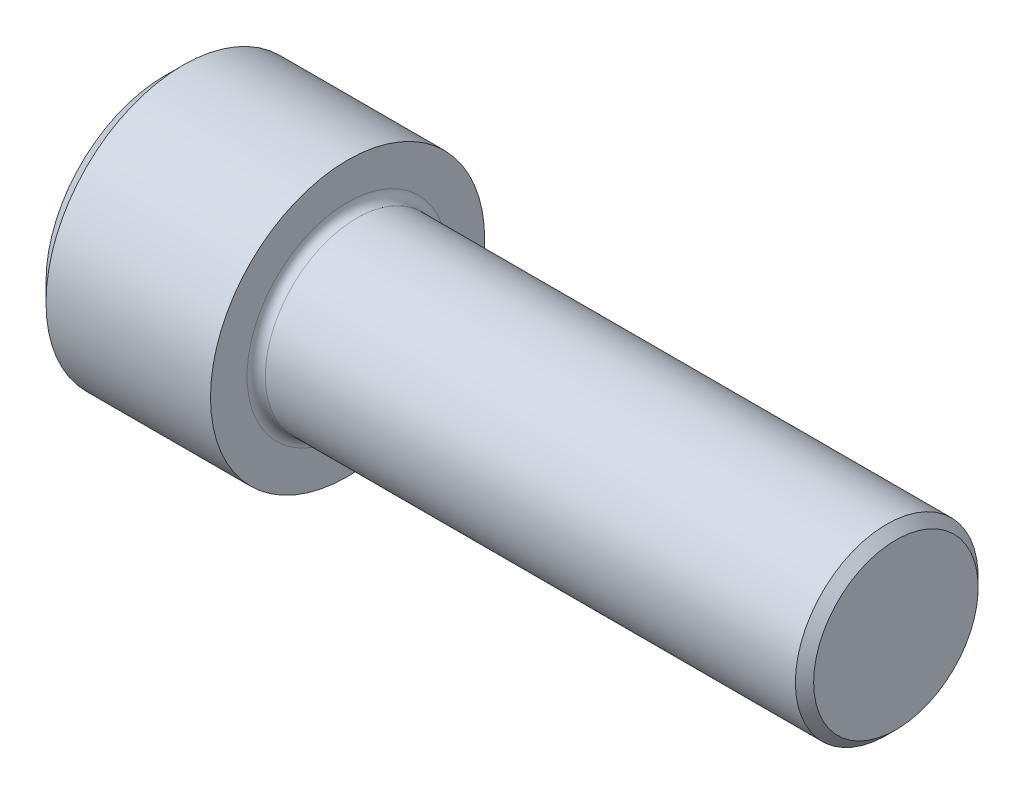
from build123d import *

# Parameters (mm, degrees)
FILLET1_R   = 1.27
HEX_2_DEPTH = 12.573


with BuildPart() as part:
    # BodySke → Base-Revolve (revolve)
    with BuildSketch(Plane.XY, mode=Mode.PRIVATE) as base_revolve_sk:
        Polygon((0, 0), (0, 16.51), (2.54, 19.05), (25.4, 19.05), (25.4, 12.7), (100.33127, 12.7), (101.6, 11.43127), (101.6, 0), align=None)
    revolve(base_revolve_sk.sketch.rotate(Axis((-31.75, 0, 0), (1, 0, 0)), 90), axis=Axis((-31.75, 0, 0), (1, 0, 0)))

    # Fillet1
    fillet1_edges = [part.edges().sort_by_distance(p)[0] for p in [
        (25.4, 0, -12.7),
    ]]
    fillet(fillet1_edges, radius=FILLET1_R)

    # Sketch2 → Hex-PreBroach (revolve, cut)
    with BuildSketch(Plane.XY, mode=Mode.PRIVATE) as hex_prebroach_sk:
        Polygon((0, 9.525), (12.573, 9.525), (18.072261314, 0), (0, 0), align=None)
    revolve(hex_prebroach_sk.sketch.rotate(Axis((0, 0, 0), (1, 0, 0)), 90), axis=Axis((0, 0, 0), (1, 0, 0)), mode=Mode.SUBTRACT)

    # Sketch3 → Hex 2 (cut)
    with BuildSketch(Plane(origin=(0, 0, 0), x_dir=(0, 0.500000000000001, 0.866025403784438), z_dir=(-1, 0, 0))):
        Polygon((5.499261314, 9.525), (-5.499261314, 9.525), (-10.998522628, 0), (-5.499261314, -9.525), (5.499261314, -9.525), (10.998522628, 0), align=None)
    extrude(amount=-HEX_2_DEPTH, mode=Mode.SUBTRACT)


solid = part.part
